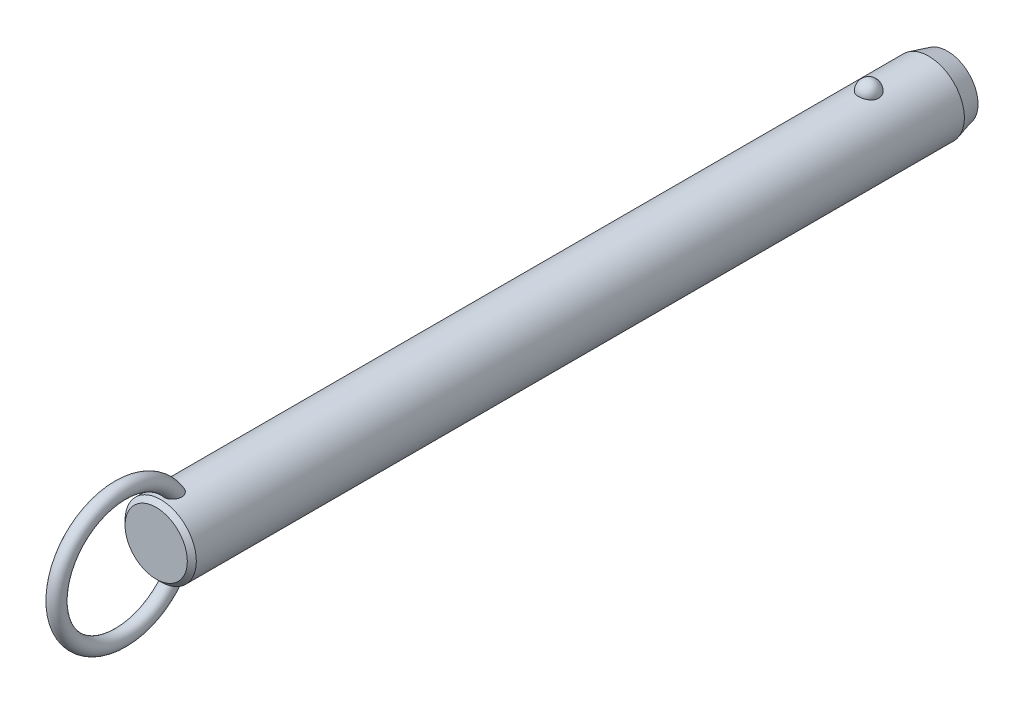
ISO-10303-21;
HEADER;
FILE_DESCRIPTION(('STEP AP214'),'2;1');
FILE_NAME('part.step','',(''),(''),'','','');
FILE_SCHEMA(('AUTOMOTIVE_DESIGN { 1 0 10303 214 1 1 1 1 }'));
ENDSEC;
DATA;
#1=APPLICATION_CONTEXT('core data for automotive mechanical design processes');
#2=APPLICATION_PROTOCOL_DEFINITION('international standard','automotive_design',2000,#1);
#3=PRODUCT_CONTEXT('',#1,'mechanical');
#4=PRODUCT('Part','Part','',(#3));
#5=PRODUCT_RELATED_PRODUCT_CATEGORY('part','',(#4));
#6=PRODUCT_DEFINITION_FORMATION('','',#4);
#7=PRODUCT_DEFINITION_CONTEXT('part definition',#1,'design');
#8=PRODUCT_DEFINITION('design','',#6,#7);
#9=PRODUCT_DEFINITION_SHAPE('','',#8);
#10=(LENGTH_UNIT() NAMED_UNIT(*) SI_UNIT(.MILLI.,.METRE.));
#11=(NAMED_UNIT(*) PLANE_ANGLE_UNIT() SI_UNIT($,.RADIAN.));
#12=(NAMED_UNIT(*) SI_UNIT($,.STERADIAN.) SOLID_ANGLE_UNIT());
#13=UNCERTAINTY_MEASURE_WITH_UNIT(LENGTH_MEASURE(1.E-05),#10,'distance_accuracy_value','');
#14=(GEOMETRIC_REPRESENTATION_CONTEXT(3) GLOBAL_UNCERTAINTY_ASSIGNED_CONTEXT((#13)) GLOBAL_UNIT_ASSIGNED_CONTEXT((#10,
#11,#12)) REPRESENTATION_CONTEXT('',''));
#15=CARTESIAN_POINT('',(0.,0.,0.));
#16=DIRECTION('',(0.,0.,1.));
#17=DIRECTION('',(1.,0.,0.));
#18=AXIS2_PLACEMENT_3D('',#15,#16,#17);
#19=CARTESIAN_POINT('',(0.,0.,177.8));
#20=DIRECTION('',(0.,0.,-1.));
#21=DIRECTION('',(-1.,0.,0.));
#22=AXIS2_PLACEMENT_3D('',#19,#20,#21);
#23=CYLINDRICAL_SURFACE('',#22,9.5);
#24=CARTESIAN_POINT('',(2.67259918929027,9.11631578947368,-2.70000000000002));
#25=CARTESIAN_POINT('',(2.6725968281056,9.11631786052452,-2.54909854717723));
#26=CARTESIAN_POINT('',(2.66030567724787,9.11994722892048,-2.39816735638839));
#27=CARTESIAN_POINT('',(2.6114347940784,9.13405924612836,-2.10058568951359));
#28=CARTESIAN_POINT('',(2.57484658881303,9.14454428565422,-1.95393672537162));
#29=CARTESIAN_POINT('',(2.47830875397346,9.17117631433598,-1.66916069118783));
#30=CARTESIAN_POINT('',(2.41836936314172,9.18732082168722,-1.53102991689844));
#31=CARTESIAN_POINT('',(2.27661331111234,9.22346780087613,-1.26705393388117));
#32=CARTESIAN_POINT('',(2.19479699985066,9.24347021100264,-1.14120852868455));
#33=CARTESIAN_POINT('',(2.01085282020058,9.28522401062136,-0.904632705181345));
#34=CARTESIAN_POINT('',(1.90862396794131,9.30698376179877,-0.793982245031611));
#35=CARTESIAN_POINT('',(1.6867437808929,9.34973971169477,-0.59160721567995));
#36=CARTESIAN_POINT('',(1.56709244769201,9.37073591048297,-0.499882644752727));
#37=CARTESIAN_POINT('',(1.31393976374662,9.40956370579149,-0.338167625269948));
#38=CARTESIAN_POINT('',(1.18048026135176,9.42740444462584,-0.268113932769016));
#39=CARTESIAN_POINT('',(0.903154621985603,9.45799906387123,-0.151390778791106));
#40=CARTESIAN_POINT('',(0.759289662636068,9.47075351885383,-0.104718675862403));
#41=CARTESIAN_POINT('',(0.468074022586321,9.48956256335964,-0.0367633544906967));
#42=CARTESIAN_POINT('',(0.320836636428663,9.49573643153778,-0.0150275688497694));
#43=CARTESIAN_POINT('',(0.0246714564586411,9.50112183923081,0.00396199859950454));
#44=CARTESIAN_POINT('',(-0.124256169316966,9.50033406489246,0.00121819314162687));
#45=CARTESIAN_POINT('',(-0.417264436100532,9.4919475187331,-0.0284441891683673));
#46=CARTESIAN_POINT('',(-0.56138413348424,9.48444885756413,-0.0550074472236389));
#47=CARTESIAN_POINT('',(-0.842986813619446,9.46357853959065,-0.131064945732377));
#48=CARTESIAN_POINT('',(-0.980469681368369,9.450206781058,-0.180559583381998));
#49=CARTESIAN_POINT('',(-1.24585005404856,9.41890822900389,-0.301476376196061));
#50=CARTESIAN_POINT('',(-1.37368611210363,9.40095498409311,-0.373026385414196));
#51=CARTESIAN_POINT('',(-1.61552738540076,9.36242964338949,-0.536025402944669));
#52=CARTESIAN_POINT('',(-1.72953116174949,9.34185727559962,-0.627476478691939));
#53=CARTESIAN_POINT('',(-1.9429225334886,9.29984568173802,-0.829844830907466));
#54=CARTESIAN_POINT('',(-2.04198021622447,9.27839736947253,-0.941108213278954));
#55=CARTESIAN_POINT('',(-2.22026460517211,9.23735994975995,-1.17883414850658));
#56=CARTESIAN_POINT('',(-2.29948985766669,9.21777097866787,-1.30529781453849));
#57=CARTESIAN_POINT('',(-2.43697287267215,9.18238994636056,-1.57158566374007));
#58=CARTESIAN_POINT('',(-2.49497068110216,9.16664569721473,-1.71155057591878));
#59=CARTESIAN_POINT('',(-2.5872073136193,9.14104303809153,-1.99961197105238));
#60=CARTESIAN_POINT('',(-2.62144683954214,9.13118445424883,-2.1477082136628));
#61=CARTESIAN_POINT('',(-2.66521466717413,9.11850622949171,-2.44715424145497));
#62=CARTESIAN_POINT('',(-2.67484831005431,9.11565658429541,-2.59848735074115));
#63=CARTESIAN_POINT('',(-2.66946735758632,9.11723375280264,-2.90067317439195));
#64=CARTESIAN_POINT('',(-2.65445345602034,9.12166036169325,-3.05152590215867));
#65=CARTESIAN_POINT('',(-2.60029711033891,9.13724422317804,-3.34766110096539));
#66=CARTESIAN_POINT('',(-2.56127978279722,9.14836656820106,-3.49296833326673));
#67=CARTESIAN_POINT('',(-2.46018844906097,9.17606676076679,-3.77477535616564));
#68=CARTESIAN_POINT('',(-2.39811349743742,9.1926448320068,-3.91127478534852));
#69=CARTESIAN_POINT('',(-2.25202303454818,9.22952198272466,-4.17244273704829));
#70=CARTESIAN_POINT('',(-2.16788714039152,9.24984129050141,-4.29704106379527));
#71=CARTESIAN_POINT('',(-1.9799408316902,9.29188255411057,-4.53013066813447));
#72=CARTESIAN_POINT('',(-1.87612963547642,9.31360456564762,-4.63862130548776));
#73=CARTESIAN_POINT('',(-1.65105429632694,9.35612959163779,-4.83690299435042));
#74=CARTESIAN_POINT('',(-1.52972405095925,9.37692871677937,-4.9266199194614));
#75=CARTESIAN_POINT('',(-1.27318250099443,9.41518970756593,-5.08429106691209));
#76=CARTESIAN_POINT('',(-1.13797219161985,9.432651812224,-5.15224684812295));
#77=CARTESIAN_POINT('',(-0.859280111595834,9.46208255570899,-5.26371827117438));
#78=CARTESIAN_POINT('',(-0.715925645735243,9.47411833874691,-5.30753421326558));
#79=CARTESIAN_POINT('',(-0.423550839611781,9.4916822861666,-5.37076321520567));
#80=CARTESIAN_POINT('',(-0.2745312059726,9.49721125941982,-5.39017930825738));
#81=CARTESIAN_POINT('',(0.0218446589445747,9.50110860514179,-5.40390587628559));
#82=CARTESIAN_POINT('',(0.16917707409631,9.49961381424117,-5.39869609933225));
#83=CARTESIAN_POINT('',(0.460808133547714,9.48993906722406,-5.36441955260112));
#84=CARTESIAN_POINT('',(0.605106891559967,9.48175936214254,-5.33535367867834));
#85=CARTESIAN_POINT('',(0.886027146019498,9.4596376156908,-5.25435587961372));
#86=CARTESIAN_POINT('',(1.02267710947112,9.44571881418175,-5.20251612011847));
#87=CARTESIAN_POINT('',(1.28523827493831,9.41358993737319,-5.07741549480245));
#88=CARTESIAN_POINT('',(1.41114877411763,9.39537958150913,-5.00415322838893));
#89=CARTESIAN_POINT('',(1.65085227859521,9.3562644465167,-4.83684599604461));
#90=CARTESIAN_POINT('',(1.76442346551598,9.33532178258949,-4.74249218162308));
#91=CARTESIAN_POINT('',(1.97425672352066,9.29321198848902,-4.53620389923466));
#92=CARTESIAN_POINT('',(2.07051582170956,9.27204482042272,-4.42426641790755));
#93=CARTESIAN_POINT('',(2.24490086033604,9.23139221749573,-4.18363183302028));
#94=CARTESIAN_POINT('',(2.32267019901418,9.21194380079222,-4.05466990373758));
#95=CARTESIAN_POINT('',(2.45584092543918,9.1773419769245,-3.78517836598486));
#96=CARTESIAN_POINT('',(2.5112497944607,9.16218713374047,-3.644652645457));
#97=CARTESIAN_POINT('',(2.59380876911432,9.13913522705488,-3.37104301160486));
#98=CARTESIAN_POINT('',(2.62330266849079,9.13064624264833,-3.23871053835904));
#99=CARTESIAN_POINT('',(2.66269870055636,9.11923566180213,-2.97092664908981));
#100=CARTESIAN_POINT('',(2.67260130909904,9.11631393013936,-2.83547530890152));
#101=CARTESIAN_POINT('',(2.67259918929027,9.11631578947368,-2.70000000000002));
#102=B_SPLINE_CURVE_WITH_KNOTS('',3,(#24,#25,#26,#27,#28,#29,#30,#31,#32,#33,#34,#35,#36,#37,
#38,#39,#40,#41,#42,#43,#44,#45,#46,#47,#48,#49,#50,#51,#52,#53,#54,#55,#56,#57,#58,#59,#60,#61,
#62,#63,#64,#65,#66,#67,#68,#69,#70,#71,#72,#73,#74,#75,#76,#77,#78,#79,#80,#81,#82,#83,#84,#85,
#86,#87,#88,#89,#90,#91,#92,#93,#94,#95,#96,#97,#98,#99,#100,#101),.UNSPECIFIED.,.T.,.F.,(4,2,2,
2,2,2,2,2,2,2,2,2,2,2,2,2,2,2,2,2,2,2,2,2,2,2,2,2,2,2,2,2,2,2,2,2,2,2,4),(0.,0.452217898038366,
0.904593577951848,1.35677112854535,1.80894144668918,2.26340676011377,2.71787203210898,
3.17099820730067,3.62407318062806,4.0687883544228,4.51345969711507,4.95160616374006,
5.38976021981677,5.83050358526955,6.27129275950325,6.72071308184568,7.17016633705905,
7.62495278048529,8.07972578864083,8.53254856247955,8.98535859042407,9.43582813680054,
9.88631615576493,10.3393155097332,10.7923328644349,11.2471065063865,11.7018475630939,
12.150795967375,12.599688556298,13.0398725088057,13.4800399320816,13.9184421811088,
14.3568730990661,14.802202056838,15.2476074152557,15.7010097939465,16.1542603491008,
16.5602594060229,16.966248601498),.UNSPECIFIED.);
#103=CARTESIAN_POINT('',(2.67259918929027,9.11631578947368,-2.70000000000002));
#104=VERTEX_POINT('',#103);
#105=EDGE_CURVE('E41',#104,#104,#102,.T.);
#106=ORIENTED_EDGE('',*,*,#105,.T.);
#107=EDGE_LOOP('',(#106));
#108=FACE_BOUND('',#107,.T.);
#109=CARTESIAN_POINT('',(0.,0.,186.12));
#110=DIRECTION('',(0.,0.,1.));
#111=DIRECTION('',(1.,0.,0.));
#112=AXIS2_PLACEMENT_3D('',#109,#110,#111);
#113=CIRCLE('',#112,9.5);
#114=CARTESIAN_POINT('',(9.5,0.,186.12));
#115=VERTEX_POINT('',#114);
#116=EDGE_CURVE('E10',#115,#115,#113,.F.);
#117=ORIENTED_EDGE('',*,*,#116,.T.);
#118=EDGE_LOOP('',(#117));
#119=FACE_BOUND('',#118,.T.);
#120=CARTESIAN_POINT('',(-0.697062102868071,-9.47439269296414,180.467808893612));
#121=CARTESIAN_POINT('',(-0.799579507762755,-9.46685146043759,180.507482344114));
#122=CARTESIAN_POINT('',(-0.898575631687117,-9.45788043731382,180.5559309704));
#123=CARTESIAN_POINT('',(-1.08670047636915,-9.43811593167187,180.668868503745));
#124=CARTESIAN_POINT('',(-1.17583204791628,-9.42732297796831,180.733352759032));
#125=CARTESIAN_POINT('',(-1.34179806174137,-9.40513672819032,180.876209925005));
#126=CARTESIAN_POINT('',(-1.41865133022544,-9.39374438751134,180.954561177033));
#127=CARTESIAN_POINT('',(-1.55860047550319,-9.37154196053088,181.122752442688));
#128=CARTESIAN_POINT('',(-1.62169476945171,-9.3607319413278,181.21259377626));
#129=CARTESIAN_POINT('',(-1.73527695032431,-9.34035749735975,181.404500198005));
#130=CARTESIAN_POINT('',(-1.78522266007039,-9.33085270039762,181.506891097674));
#131=CARTESIAN_POINT('',(-1.86924997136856,-9.3143834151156,181.718148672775));
#132=CARTESIAN_POINT('',(-1.90332570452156,-9.30741986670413,181.827017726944));
#133=CARTESIAN_POINT('',(-1.95893603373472,-9.29588482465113,182.060473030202));
#134=CARTESIAN_POINT('',(-1.97872420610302,-9.29165182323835,182.185489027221));
#135=CARTESIAN_POINT('',(-2.00062129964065,-9.28695978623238,182.437080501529));
#136=CARTESIAN_POINT('',(-2.00272284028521,-9.28650232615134,182.563656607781));
#137=CARTESIAN_POINT('',(-1.98958876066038,-9.28932750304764,182.836815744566));
#138=CARTESIAN_POINT('',(-1.97143366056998,-9.2932400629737,182.983251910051));
#139=CARTESIAN_POINT('',(-1.91479925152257,-9.30507151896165,183.272062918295));
#140=CARTESIAN_POINT('',(-1.87629122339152,-9.31299607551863,183.414431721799));
#141=CARTESIAN_POINT('',(-1.77225683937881,-9.33340232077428,183.715172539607));
#142=CARTESIAN_POINT('',(-1.70334898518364,-9.34641636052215,183.872369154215));
#143=CARTESIAN_POINT('',(-1.58111062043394,-9.36759153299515,184.097517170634));
#144=CARTESIAN_POINT('',(-1.53721459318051,-9.37492619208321,184.170796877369));
#145=CARTESIAN_POINT('',(-1.4430263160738,-9.38988566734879,184.31307405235));
#146=CARTESIAN_POINT('',(-1.39273721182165,-9.39751033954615,184.382073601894));
#147=CARTESIAN_POINT('',(-1.26775962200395,-9.41530678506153,184.536983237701));
#148=CARTESIAN_POINT('',(-1.19052326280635,-9.42548108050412,184.620871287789));
#149=CARTESIAN_POINT('',(-1.02420241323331,-9.44499825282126,184.776008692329));
#150=CARTESIAN_POINT('',(-0.93513986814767,-9.45434261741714,184.847280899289));
#151=CARTESIAN_POINT('',(-0.766610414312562,-9.46930670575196,184.958695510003));
#152=CARTESIAN_POINT('',(-0.689439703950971,-9.47529223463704,185.002235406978));
#153=CARTESIAN_POINT('',(-0.528942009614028,-9.48560294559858,185.07631336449));
#154=CARTESIAN_POINT('',(-0.445620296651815,-9.48992953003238,185.106862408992));
#155=CARTESIAN_POINT('',(-0.273901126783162,-9.49644161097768,185.152579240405));
#156=CARTESIAN_POINT('',(-0.18546574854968,-9.49860811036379,185.16761059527));
#157=CARTESIAN_POINT('',(-0.00734541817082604,-9.5004135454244,185.180149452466));
#158=CARTESIAN_POINT('',(0.0823387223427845,-9.50005405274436,185.177667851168));
#159=CARTESIAN_POINT('',(0.24767927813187,-9.49708301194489,185.156995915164));
#160=CARTESIAN_POINT('',(0.323620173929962,-9.49477609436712,185.140930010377));
#161=CARTESIAN_POINT('',(0.471981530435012,-9.48855917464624,185.097172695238));
#162=CARTESIAN_POINT('',(0.544400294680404,-9.48464840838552,185.069475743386));
#163=CARTESIAN_POINT('',(0.708947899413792,-9.47398336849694,184.99280266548));
#164=CARTESIAN_POINT('',(0.799149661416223,-9.46671310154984,184.939774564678));
#165=CARTESIAN_POINT('',(0.969783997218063,-9.45076225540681,184.819973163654));
#166=CARTESIAN_POINT('',(1.050194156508,-9.44207854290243,184.753169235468));
#167=CARTESIAN_POINT('',(1.2309234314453,-9.42051459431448,184.580759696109));
#168=CARTESIAN_POINT('',(1.32652499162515,-9.40733378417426,184.47026193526));
#169=CARTESIAN_POINT('',(1.49893121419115,-9.38140745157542,184.235561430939));
#170=CARTESIAN_POINT('',(1.5757161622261,-9.36866239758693,184.111344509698));
#171=CARTESIAN_POINT('',(1.71285426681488,-9.34457644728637,183.849389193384));
#172=CARTESIAN_POINT('',(1.77266365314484,-9.33328726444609,183.71136233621));
#173=CARTESIAN_POINT('',(1.87239208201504,-9.31379209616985,183.428051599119));
#174=CARTESIAN_POINT('',(1.91230158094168,-9.3055875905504,183.282764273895));
#175=CARTESIAN_POINT('',(1.97604189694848,-9.29228394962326,182.962028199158));
#176=CARTESIAN_POINT('',(1.9958743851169,-9.28797202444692,182.785724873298));
#177=CARTESIAN_POINT('',(2.0029570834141,-9.28645519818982,182.432414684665));
#178=CARTESIAN_POINT('',(1.99025930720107,-9.28923895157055,182.255409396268));
#179=CARTESIAN_POINT('',(1.93735479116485,-9.30038134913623,181.956338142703));
#180=CARTESIAN_POINT('',(1.90576827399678,-9.30697680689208,181.832667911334));
#181=CARTESIAN_POINT('',(1.8228748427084,-9.32356855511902,181.592329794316));
#182=CARTESIAN_POINT('',(1.77158213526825,-9.33356239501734,181.475656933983));
#183=CARTESIAN_POINT('',(1.64885744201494,-9.35602275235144,181.252706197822));
#184=CARTESIAN_POINT('',(1.57730995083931,-9.36850332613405,181.146492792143));
#185=CARTESIAN_POINT('',(1.41543264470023,-9.39431873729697,180.949553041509));
#186=CARTESIAN_POINT('',(1.32510883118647,-9.40765330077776,180.858821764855));
#187=CARTESIAN_POINT('',(1.13846223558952,-9.43195720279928,180.705033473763));
#188=CARTESIAN_POINT('',(1.04369890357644,-9.44302894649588,180.640094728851));
#189=CARTESIAN_POINT('',(0.843965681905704,-9.46296805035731,180.528038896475));
#190=CARTESIAN_POINT('',(0.739000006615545,-9.47183631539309,180.480914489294));
#191=CARTESIAN_POINT('',(0.528175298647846,-9.48586140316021,180.408117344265));
#192=CARTESIAN_POINT('',(0.422686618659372,-9.49119633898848,180.38140249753));
#193=CARTESIAN_POINT('',(0.208590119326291,-9.49831365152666,180.346013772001));
#194=CARTESIAN_POINT('',(0.0999817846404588,-9.500095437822,180.337342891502));
#195=CARTESIAN_POINT('',(-0.126104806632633,-9.49988861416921,180.338350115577));
#196=CARTESIAN_POINT('',(-0.243578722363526,-9.49757821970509,180.349594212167));
#197=CARTESIAN_POINT('',(-0.474390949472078,-9.48885165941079,180.393167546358));
#198=CARTESIAN_POINT('',(-0.587729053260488,-9.48243528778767,180.425497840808));
#199=CARTESIAN_POINT('',(-0.697062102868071,-9.47439269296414,180.467808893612));
#200=B_SPLINE_CURVE_WITH_KNOTS('',3,(#120,#121,#122,#123,#124,#125,#126,#127,#128,#129,#130,
#131,#132,#133,#134,#135,#136,#137,#138,#139,#140,#141,#142,#143,#144,#145,#146,#147,#148,#149,
#150,#151,#152,#153,#154,#155,#156,#157,#158,#159,#160,#161,#162,#163,#164,#165,#166,#167,#168,
#169,#170,#171,#172,#173,#174,#175,#176,#177,#178,#179,#180,#181,#182,#183,#184,#185,#186,#187,
#188,#189,#190,#191,#192,#193,#194,#195,#196,#197,#198,#199),.UNSPECIFIED.,.T.,.F.,(4,2,2,2,2,2,
2,2,2,2,2,2,2,2,2,2,2,2,2,2,2,2,2,2,2,2,2,2,2,2,2,2,2,2,2,2,2,2,2,4),(0.,0.330119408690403,
0.660143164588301,0.989655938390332,1.31920659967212,1.66074728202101,2.00241415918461,
2.38088696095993,2.75951768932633,3.20065679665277,3.64242004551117,4.15620996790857,
4.4131416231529,4.66994734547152,5.01228664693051,5.35399933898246,5.61943037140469,
5.88463652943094,6.15215502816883,6.4195070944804,6.65144391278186,6.88349136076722,
7.19641200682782,7.51003602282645,7.94779711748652,8.3860149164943,8.83699707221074,
9.28819530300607,9.81778662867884,10.34653170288,10.7284172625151,11.1100280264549,
11.4938603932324,11.8775702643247,12.2220189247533,12.5663259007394,12.8915939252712,
13.2169159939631,13.5689650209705,13.9210316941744),.UNSPECIFIED.);
#201=CARTESIAN_POINT('',(-0.697062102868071,-9.47439269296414,180.467808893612));
#202=VERTEX_POINT('',#201);
#203=EDGE_CURVE('E58',#202,#202,#200,.T.);
#204=ORIENTED_EDGE('',*,*,#203,.T.);
#205=EDGE_LOOP('',(#204));
#206=FACE_BOUND('',#205,.T.);
#207=CARTESIAN_POINT('',(-0.697062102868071,9.47439269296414,180.467808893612));
#208=CARTESIAN_POINT('',(-0.597792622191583,9.48169483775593,180.42939564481));
#209=CARTESIAN_POINT('',(-0.495106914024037,9.48766580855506,180.399168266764));
#210=CARTESIAN_POINT('',(-0.285876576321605,9.49627648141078,180.356032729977));
#211=CARTESIAN_POINT('',(-0.179324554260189,9.49890941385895,180.343159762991));
#212=CARTESIAN_POINT('',(0.0344157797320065,9.50053798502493,180.335166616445));
#213=CARTESIAN_POINT('',(0.141603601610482,9.49953613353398,180.340034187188));
#214=CARTESIAN_POINT('',(0.35356357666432,9.49401038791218,180.367365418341));
#215=CARTESIAN_POINT('',(0.458336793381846,9.48948807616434,180.38982117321));
#216=CARTESIAN_POINT('',(0.662493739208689,9.4774236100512,180.451671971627));
#217=CARTESIAN_POINT('',(0.761881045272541,9.46988348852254,180.491055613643));
#218=CARTESIAN_POINT('',(0.95260839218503,9.45260382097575,180.585634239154));
#219=CARTESIAN_POINT('',(1.04394806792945,9.44286417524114,180.640829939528));
#220=CARTESIAN_POINT('',(1.21712767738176,9.42211760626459,180.766066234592));
#221=CARTESIAN_POINT('',(1.29885671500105,9.41109835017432,180.836257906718));
#222=CARTESIAN_POINT('',(1.44978975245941,9.38903310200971,180.988980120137));
#223=CARTESIAN_POINT('',(1.51899278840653,9.37798710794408,181.071511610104));
#224=CARTESIAN_POINT('',(1.64602857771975,9.35654375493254,181.249776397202));
#225=CARTESIAN_POINT('',(1.70333052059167,9.34618688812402,181.345891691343));
#226=CARTESIAN_POINT('',(1.80259341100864,9.32755128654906,181.545897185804));
#227=CARTESIAN_POINT('',(1.84454942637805,9.31927322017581,181.649789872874));
#228=CARTESIAN_POINT('',(1.91637039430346,9.30478365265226,181.872213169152));
#229=CARTESIAN_POINT('',(1.944805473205,9.29882552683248,181.991219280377));
#230=CARTESIAN_POINT('',(1.98449865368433,9.29043398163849,182.232143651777));
#231=CARTESIAN_POINT('',(1.99574908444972,9.28800213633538,182.354063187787));
#232=CARTESIAN_POINT('',(2.00275141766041,9.28649645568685,182.616932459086));
#233=CARTESIAN_POINT('',(1.99588238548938,9.28799035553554,182.757952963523));
#234=CARTESIAN_POINT('',(1.96270559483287,9.29505517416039,183.037621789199));
#235=CARTESIAN_POINT('',(1.93637872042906,9.30063010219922,183.176267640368));
#236=CARTESIAN_POINT('',(1.85949176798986,9.31633564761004,183.472561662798));
#237=CARTESIAN_POINT('',(1.80549792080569,9.3270926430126,183.629290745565));
#238=CARTESIAN_POINT('',(1.67376869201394,9.3516306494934,183.932284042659));
#239=CARTESIAN_POINT('',(1.59603181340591,9.36541185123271,184.078547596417));
#240=CARTESIAN_POINT('',(1.4360277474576,9.39110706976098,184.325813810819));
#241=CARTESIAN_POINT('',(1.35831795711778,9.40278656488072,184.429791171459));
#242=CARTESIAN_POINT('',(1.18774483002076,9.42585025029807,184.624534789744));
#243=CARTESIAN_POINT('',(1.09490932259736,9.43723493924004,184.715324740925));
#244=CARTESIAN_POINT('',(0.921110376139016,9.45552616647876,184.85620334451));
#245=CARTESIAN_POINT('',(0.843738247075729,9.46281058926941,184.910656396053));
#246=CARTESIAN_POINT('',(0.681245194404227,9.47589120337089,185.006711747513));
#247=CARTESIAN_POINT('',(0.596135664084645,9.48168953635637,185.048332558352));
#248=CARTESIAN_POINT('',(0.433779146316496,9.49038144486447,185.110089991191));
#249=CARTESIAN_POINT('',(0.357459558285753,9.49359170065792,185.13260136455));
#250=CARTESIAN_POINT('',(0.202074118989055,9.49816761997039,185.164574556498));
#251=CARTESIAN_POINT('',(0.123010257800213,9.49953459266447,185.174045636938));
#252=CARTESIAN_POINT('',(-0.0357372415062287,9.50026497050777,185.179114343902));
#253=CARTESIAN_POINT('',(-0.115421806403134,9.49962433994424,185.174684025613));
#254=CARTESIAN_POINT('',(-0.272823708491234,9.49640854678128,185.152296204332));
#255=CARTESIAN_POINT('',(-0.350540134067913,9.4938325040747,185.134332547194));
#256=CARTESIAN_POINT('',(-0.500580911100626,9.48709462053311,185.086802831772));
#257=CARTESIAN_POINT('',(-0.572979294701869,9.48296359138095,185.057461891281));
#258=CARTESIAN_POINT('',(-0.712864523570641,9.47347609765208,184.989008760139));
#259=CARTESIAN_POINT('',(-0.780349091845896,9.46811906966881,184.949892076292));
#260=CARTESIAN_POINT('',(-0.946309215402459,9.45329720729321,184.839432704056));
#261=CARTESIAN_POINT('',(-1.04090230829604,9.44321512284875,184.762329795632));
#262=CARTESIAN_POINT('',(-1.21661929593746,9.42219227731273,184.59409718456));
#263=CARTESIAN_POINT('',(-1.29770519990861,9.41124921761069,184.502929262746));
#264=CARTESIAN_POINT('',(-1.47319646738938,9.38563439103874,184.276162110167));
#265=CARTESIAN_POINT('',(-1.56208878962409,9.37102009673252,184.136289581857));
#266=CARTESIAN_POINT('',(-1.71623987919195,9.34401559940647,183.843950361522));
#267=CARTESIAN_POINT('',(-1.78147866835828,9.33162728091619,183.691473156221));
#268=CARTESIAN_POINT('',(-1.88853837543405,9.31055541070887,183.375647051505));
#269=CARTESIAN_POINT('',(-1.92998995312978,9.30193076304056,183.212168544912));
#270=CARTESIAN_POINT('',(-1.98590726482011,9.29015757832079,182.880526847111));
#271=CARTESIAN_POINT('',(-2.0004070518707,9.2870021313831,182.712369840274));
#272=CARTESIAN_POINT('',(-1.99964701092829,9.28716218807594,182.405080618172));
#273=CARTESIAN_POINT('',(-1.98908145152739,9.28945704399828,182.265936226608));
#274=CARTESIAN_POINT('',(-1.94566294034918,9.29865169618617,181.991153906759));
#275=CARTESIAN_POINT('',(-1.9128206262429,9.30554929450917,181.855514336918));
#276=CARTESIAN_POINT('',(-1.84582133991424,9.31898248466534,181.657802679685));
#277=CARTESIAN_POINT('',(-1.82038084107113,9.32400364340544,181.592583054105));
#278=CARTESIAN_POINT('',(-1.76350511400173,9.33492884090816,181.464903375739));
#279=CARTESIAN_POINT('',(-1.73207305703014,9.34083241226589,181.402441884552));
#280=CARTESIAN_POINT('',(-1.66324243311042,9.35333332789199,181.28094078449));
#281=CARTESIAN_POINT('',(-1.62584239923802,9.35993084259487,181.221902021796));
#282=CARTESIAN_POINT('',(-1.54527678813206,9.37356864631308,181.107987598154));
#283=CARTESIAN_POINT('',(-1.50211241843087,9.38060884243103,181.053111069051));
#284=CARTESIAN_POINT('',(-1.37681147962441,9.40004442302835,180.909961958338));
#285=CARTESIAN_POINT('',(-1.28916358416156,9.41261047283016,180.826429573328));
#286=CARTESIAN_POINT('',(-1.09996826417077,9.43658180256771,180.677236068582));
#287=CARTESIAN_POINT('',(-0.998461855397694,9.44799034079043,180.611523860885));
#288=CARTESIAN_POINT('',(-0.860188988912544,9.46103017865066,180.5394367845));
#289=CARTESIAN_POINT('',(-0.828141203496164,9.46389141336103,180.523851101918));
#290=CARTESIAN_POINT('',(-0.763210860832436,9.46934915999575,180.494473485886));
#291=CARTESIAN_POINT('',(-0.730328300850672,9.47194567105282,180.480681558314));
#292=CARTESIAN_POINT('',(-0.697062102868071,9.47439269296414,180.467808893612));
#293=B_SPLINE_CURVE_WITH_KNOTS('',3,(#207,#208,#209,#210,#211,#212,#213,#214,#215,#216,#217,
#218,#219,#220,#221,#222,#223,#224,#225,#226,#227,#228,#229,#230,#231,#232,#233,#234,#235,#236,
#237,#238,#239,#240,#241,#242,#243,#244,#245,#246,#247,#248,#249,#250,#251,#252,#253,#254,#255,
#256,#257,#258,#259,#260,#261,#262,#263,#264,#265,#266,#267,#268,#269,#270,#271,#272,#273,#274,
#275,#276,#277,#278,#279,#280,#281,#282,#283,#284,#285,#286,#287,#288,#289,#290,#291,#292),
.UNSPECIFIED.,.T.,.F.,(4,2,2,2,2,2,2,2,2,2,2,2,2,2,2,2,2,2,2,2,2,2,2,2,2,2,2,2,2,2,2,2,2,2,2,2,
2,2,2,2,2,2,4),(0.,0.319942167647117,0.640532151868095,0.96090081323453,1.2811255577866,
1.60113495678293,1.92115886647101,2.24457323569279,2.56801248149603,2.90371927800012,
3.23953387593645,3.60560313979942,3.97183576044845,4.39383693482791,4.8162532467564,
5.31257045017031,5.80891895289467,6.19868344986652,6.58773876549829,6.87145417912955,
7.15475838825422,7.39263751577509,7.63034760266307,7.86853584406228,8.10683246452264,
8.3406366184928,8.57454843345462,8.93983939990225,9.30614105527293,9.80266668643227,
10.2996107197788,10.8040753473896,11.3079021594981,11.7249776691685,12.1418541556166,
12.3521485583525,12.5623319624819,12.7725671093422,12.9827582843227,13.345827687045,
13.7078449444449,13.8150604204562,13.9222762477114),.UNSPECIFIED.);
#294=CARTESIAN_POINT('',(-0.697062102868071,9.47439269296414,180.467808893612));
#295=VERTEX_POINT('',#294);
#296=EDGE_CURVE('E66',#295,#295,#293,.T.);
#297=ORIENTED_EDGE('',*,*,#296,.T.);
#298=EDGE_LOOP('',(#297));
#299=FACE_BOUND('',#298,.T.);
#300=CARTESIAN_POINT('',(0.,0.,-18.6999999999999));
#301=DIRECTION('',(0.,0.,-1.));
#302=DIRECTION('',(-1.,0.,0.));
#303=AXIS2_PLACEMENT_3D('',#300,#301,#302);
#304=CIRCLE('',#303,9.5);
#305=CARTESIAN_POINT('',(-9.5,0.,-18.6999999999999));
#306=VERTEX_POINT('',#305);
#307=EDGE_CURVE('E55',#306,#306,#304,.F.);
#308=ORIENTED_EDGE('',*,*,#307,.T.);
#309=EDGE_LOOP('',(#308));
#310=FACE_BOUND('',#309,.T.);
#311=ADVANCED_FACE('F37',(#108,#119,#206,#299,#310),#23,.T.);
#312=CARTESIAN_POINT('',(0.,0.,-23.7));
#313=DIRECTION('',(0.,0.,-1.));
#314=DIRECTION('',(-1.,0.,0.));
#315=AXIS2_PLACEMENT_3D('',#312,#313,#314);
#316=PLANE('',#315);
#317=CARTESIAN_POINT('',(0.,0.,-23.7));
#318=DIRECTION('',(0.,0.,-1.));
#319=DIRECTION('',(-1.,0.,0.));
#320=AXIS2_PLACEMENT_3D('',#317,#318,#319);
#321=CIRCLE('',#320,8.16025403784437);
#322=CARTESIAN_POINT('',(-8.16025403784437,0.,-23.7));
#323=VERTEX_POINT('',#322);
#324=EDGE_CURVE('E65',#323,#323,#321,.T.);
#325=ORIENTED_EDGE('',*,*,#324,.T.);
#326=EDGE_LOOP('',(#325));
#327=FACE_BOUND('',#326,.T.);
#328=ADVANCED_FACE('F84',(#327),#316,.T.);
#329=CARTESIAN_POINT('',(0.,0.,-23.7));
#330=DIRECTION('',(0.,0.,1.));
#331=DIRECTION('',(1.,0.,0.));
#332=AXIS2_PLACEMENT_3D('',#329,#330,#331);
#333=CONICAL_SURFACE('',#332,8.16025403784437,0.261799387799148);
#334=ORIENTED_EDGE('',*,*,#307,.F.);
#335=EDGE_LOOP('',(#334));
#336=FACE_BOUND('',#335,.T.);
#337=ORIENTED_EDGE('',*,*,#324,.F.);
#338=EDGE_LOOP('',(#337));
#339=FACE_BOUND('',#338,.T.);
#340=ADVANCED_FACE('F82',(#336,#339),#333,.T.);
#341=CARTESIAN_POINT('',(0.,0.,187.32));
#342=DIRECTION('',(0.,0.,1.));
#343=DIRECTION('',(1.,0.,0.));
#344=AXIS2_PLACEMENT_3D('',#341,#342,#343);
#345=PLANE('',#344);
#346=CARTESIAN_POINT('',(0.,0.,187.32));
#347=DIRECTION('',(0.,0.,1.));
#348=DIRECTION('',(1.,0.,0.));
#349=AXIS2_PLACEMENT_3D('',#346,#347,#348);
#350=CIRCLE('',#349,8.29999999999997);
#351=CARTESIAN_POINT('',(8.29999999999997,0.,187.32));
#352=VERTEX_POINT('',#351);
#353=EDGE_CURVE('E50',#352,#352,#350,.T.);
#354=ORIENTED_EDGE('',*,*,#353,.T.);
#355=EDGE_LOOP('',(#354));
#356=FACE_BOUND('',#355,.T.);
#357=ADVANCED_FACE('F76',(#356),#345,.T.);
#358=CARTESIAN_POINT('',(0.,0.,196.85));
#359=DIRECTION('',(1.,0.,0.));
#360=DIRECTION('',(0.,0.,-1.));
#361=AXIS2_PLACEMENT_3D('',#358,#359,#360);
#362=TOROIDAL_SURFACE('',#361,17.05,2.);
#363=ORIENTED_EDGE('',*,*,#296,.F.);
#364=EDGE_LOOP('',(#363));
#365=FACE_BOUND('',#364,.T.);
#366=ORIENTED_EDGE('',*,*,#203,.F.);
#367=EDGE_LOOP('',(#366));
#368=FACE_BOUND('',#367,.T.);
#369=ADVANCED_FACE('F72',(#365,#368),#362,.T.);
#370=CARTESIAN_POINT('',(0.,0.,187.32));
#371=DIRECTION('',(0.,0.,-1.));
#372=DIRECTION('',(-1.,0.,0.));
#373=AXIS2_PLACEMENT_3D('',#370,#371,#372);
#374=CONICAL_SURFACE('',#373,8.29999999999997,0.785398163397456);
#375=ORIENTED_EDGE('',*,*,#116,.F.);
#376=EDGE_LOOP('',(#375));
#377=FACE_BOUND('',#376,.T.);
#378=ORIENTED_EDGE('',*,*,#353,.F.);
#379=EDGE_LOOP('',(#378));
#380=FACE_BOUND('',#379,.T.);
#381=ADVANCED_FACE('F39',(#377,#380),#374,.T.);
#382=CARTESIAN_POINT('',(0.,9.5,-2.70000000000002));
#383=DIRECTION('',(0.,1.,0.));
#384=DIRECTION('',(0.,0.,-1.));
#385=AXIS2_PLACEMENT_3D('',#382,#383,#384);
#386=SPHERICAL_SURFACE('',#385,2.7);
#387=ORIENTED_EDGE('',*,*,#105,.F.);
#388=EDGE_LOOP('',(#387));
#389=FACE_BOUND('',#388,.T.);
#390=ADVANCED_FACE('F78',(#389),#386,.T.);
#391=CLOSED_SHELL('',(#311,#328,#340,#357,#369,#381,#390));
#392=MANIFOLD_SOLID_BREP('B2',#391);
#393=ADVANCED_BREP_SHAPE_REPRESENTATION('',(#18,#392),#14);
#394=SHAPE_DEFINITION_REPRESENTATION(#9,#393);
ENDSEC;
END-ISO-10303-21;
